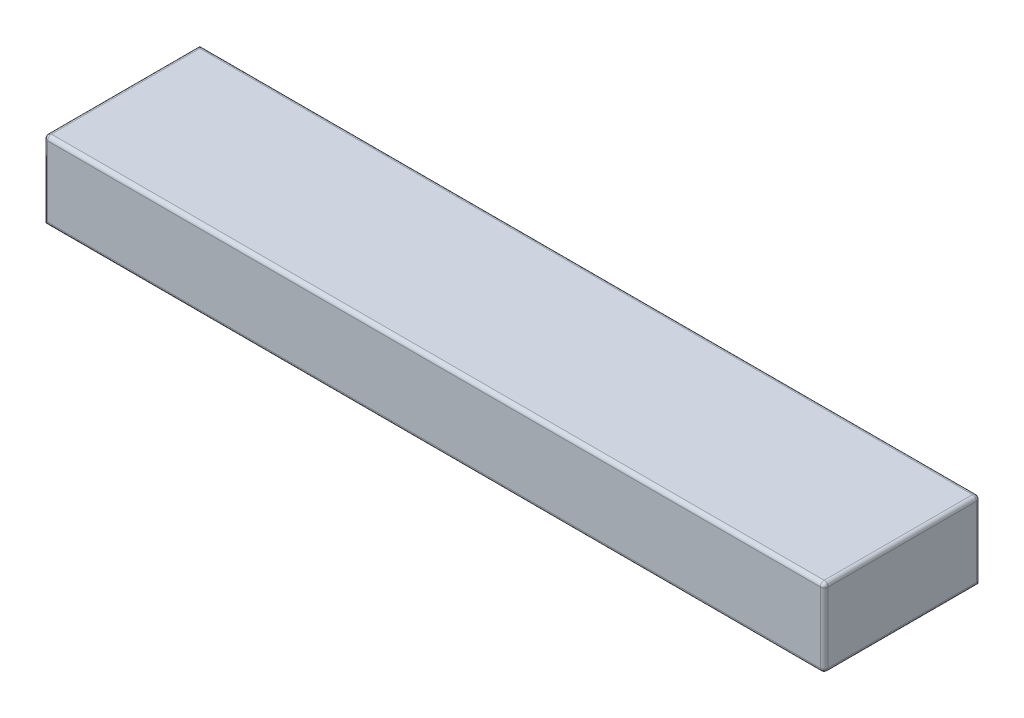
from build123d import *

# Parameters (mm, degrees)
SKETCH1_W           = 100
SKETCH1_H           = 20
BOSS_EXTRUDE1_DEPTH = 10
FILLET1_R           = 0.5


with BuildPart() as part:
    # Sketch1 → Boss-Extrude1 (new body)
    with BuildSketch(Plane(origin=(0, 0, 0), x_dir=(1, 0, 0), z_dir=(0, 1, 0))):
        with Locations((50, -10)):
            Rectangle(SKETCH1_W, SKETCH1_H)
    extrude(amount=BOSS_EXTRUDE1_DEPTH)

    # Fillet1
    fillet1_edges = [part.edges().sort_by_distance(p)[0] for p in [
        (100, 10, 10),
        (50, 10, 0),
        (0, 10, 10),
        (100, 0, 10),
        (50, 0, 20),
        (50, 10, 20),
        (100, 5, 0),
        (100, 5, 20),
        (0, 5, 20),
    ]]
    fillet(fillet1_edges, radius=FILLET1_R)


solid = part.part
